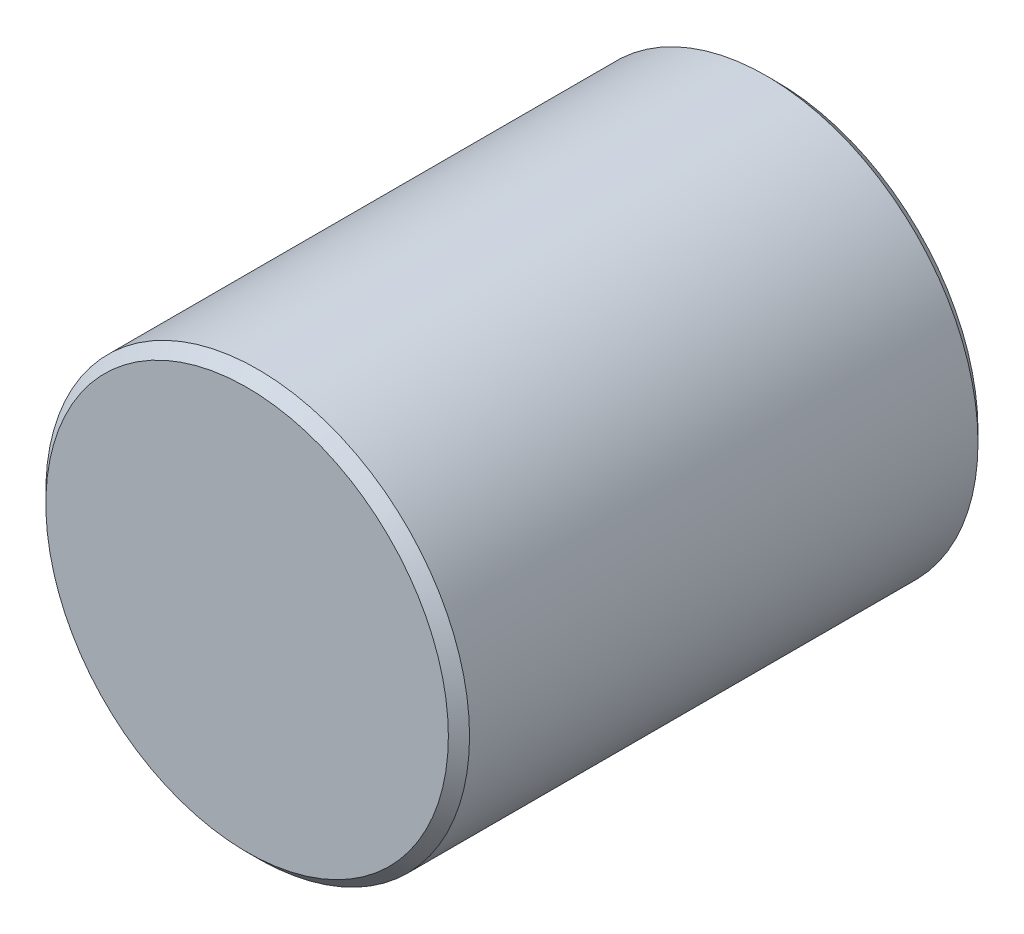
from build123d import *

# Parameters (mm, degrees)
SKETCH1_R      = 50.8
EXTRUDE1_DEPTH = 127
CHAMFER1_SIZE  = 2.54


with BuildPart() as part:
    # Sketch1 → Extrude1 (new body)
    with BuildSketch(Plane.XY):
        Circle(SKETCH1_R)
    extrude(amount=EXTRUDE1_DEPTH)

    # Chamfer1
    chamfer1_edges = [part.edges().sort_by_distance(p)[0] for p in [
        (-50.8, 0, 0),
        (-50.8, 0, 127),
    ]]
    chamfer(chamfer1_edges, length=CHAMFER1_SIZE)


solid = part.part
